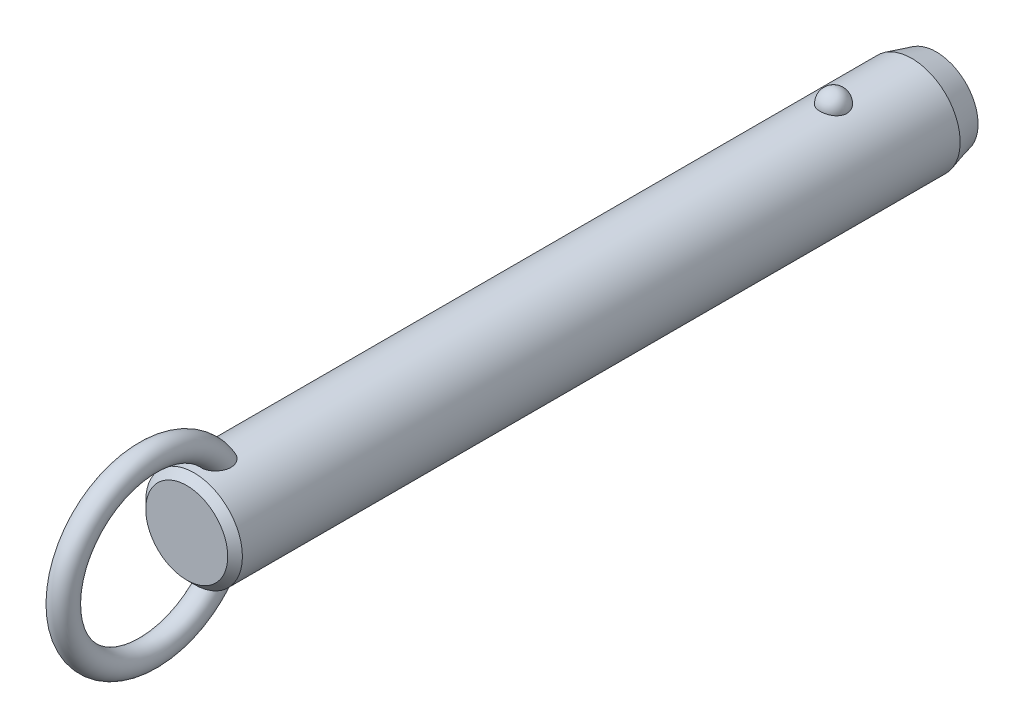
ISO-10303-21;
HEADER;
FILE_DESCRIPTION(('STEP AP214'),'2;1');
FILE_NAME('part.step','',(''),(''),'','','');
FILE_SCHEMA(('AUTOMOTIVE_DESIGN { 1 0 10303 214 1 1 1 1 }'));
ENDSEC;
DATA;
#1=APPLICATION_CONTEXT('core data for automotive mechanical design processes');
#2=APPLICATION_PROTOCOL_DEFINITION('international standard','automotive_design',2000,#1);
#3=PRODUCT_CONTEXT('',#1,'mechanical');
#4=PRODUCT('Part','Part','',(#3));
#5=PRODUCT_RELATED_PRODUCT_CATEGORY('part','',(#4));
#6=PRODUCT_DEFINITION_FORMATION('','',#4);
#7=PRODUCT_DEFINITION_CONTEXT('part definition',#1,'design');
#8=PRODUCT_DEFINITION('design','',#6,#7);
#9=PRODUCT_DEFINITION_SHAPE('','',#8);
#10=(LENGTH_UNIT() NAMED_UNIT(*) SI_UNIT(.MILLI.,.METRE.));
#11=(NAMED_UNIT(*) PLANE_ANGLE_UNIT() SI_UNIT($,.RADIAN.));
#12=(NAMED_UNIT(*) SI_UNIT($,.STERADIAN.) SOLID_ANGLE_UNIT());
#13=UNCERTAINTY_MEASURE_WITH_UNIT(LENGTH_MEASURE(1.E-05),#10,'distance_accuracy_value','');
#14=(GEOMETRIC_REPRESENTATION_CONTEXT(3) GLOBAL_UNCERTAINTY_ASSIGNED_CONTEXT((#13)) GLOBAL_UNIT_ASSIGNED_CONTEXT((#10,
#11,#12)) REPRESENTATION_CONTEXT('',''));
#15=CARTESIAN_POINT('',(0.,0.,0.));
#16=DIRECTION('',(0.,0.,1.));
#17=DIRECTION('',(1.,0.,0.));
#18=AXIS2_PLACEMENT_3D('',#15,#16,#17);
#19=CARTESIAN_POINT('',(0.,0.,94.));
#20=DIRECTION('',(0.,0.,-1.));
#21=DIRECTION('',(-1.,0.,0.));
#22=AXIS2_PLACEMENT_3D('',#19,#20,#21);
#23=CYLINDRICAL_SURFACE('',#22,7.9);
#24=CARTESIAN_POINT('',(2.1785689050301,7.59367088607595,-2.19999999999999));
#25=CARTESIAN_POINT('',(2.17856679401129,7.59367269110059,-2.07701843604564));
#26=CARTESIAN_POINT('',(2.16853481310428,7.59657145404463,-1.95401006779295));
#27=CARTESIAN_POINT('',(2.12864689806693,7.607843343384,-1.71147811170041));
#28=CARTESIAN_POINT('',(2.09878338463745,7.61621856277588,-1.59195587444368));
#29=CARTESIAN_POINT('',(2.0199931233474,7.63749180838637,-1.3598563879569));
#30=CARTESIAN_POINT('',(1.97107475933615,7.6503878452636,-1.24727610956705));
#31=CARTESIAN_POINT('',(1.85539377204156,7.67926115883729,-1.03213234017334));
#32=CARTESIAN_POINT('',(1.78863158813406,7.69523835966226,-0.929568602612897));
#33=CARTESIAN_POINT('',(1.63856494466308,7.7285848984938,-0.736786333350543));
#34=CARTESIAN_POINT('',(1.55518140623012,7.7459606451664,-0.646630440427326));
#35=CARTESIAN_POINT('',(1.37422937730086,7.78009978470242,-0.481747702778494));
#36=CARTESIAN_POINT('',(1.27666086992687,7.79686317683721,-0.407020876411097));
#37=CARTESIAN_POINT('',(1.07024728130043,7.82786153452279,-0.275278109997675));
#38=CARTESIAN_POINT('',(0.961434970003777,7.84210353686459,-0.218212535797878));
#39=CARTESIAN_POINT('',(0.735351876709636,7.86652194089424,-0.123146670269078));
#40=CARTESIAN_POINT('',(0.618082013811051,7.87669878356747,-0.085144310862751));
#41=CARTESIAN_POINT('',(0.380637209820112,7.89170521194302,-0.0298158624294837));
#42=CARTESIAN_POINT('',(0.260550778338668,7.89662650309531,-0.0121347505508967));
#43=CARTESIAN_POINT('',(0.0190117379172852,7.90090003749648,0.00324379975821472));
#44=CARTESIAN_POINT('',(-0.102440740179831,7.90025280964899,0.00094313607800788));
#45=CARTESIAN_POINT('',(-0.341452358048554,7.89351056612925,-0.0233955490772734));
#46=CARTESIAN_POINT('',(-0.459042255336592,7.88749257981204,-0.0451545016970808));
#47=CARTESIAN_POINT('',(-0.688796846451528,7.87075812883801,-0.107408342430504));
#48=CARTESIAN_POINT('',(-0.800961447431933,7.86004158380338,-0.147903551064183));
#49=CARTESIAN_POINT('',(-1.01743634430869,7.83497131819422,-0.246799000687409));
#50=CARTESIAN_POINT('',(-1.12169791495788,7.82059709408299,-0.305300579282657));
#51=CARTESIAN_POINT('',(-1.31891765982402,7.78976470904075,-0.438549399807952));
#52=CARTESIAN_POINT('',(-1.41187469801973,7.77330633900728,-0.513298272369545));
#53=CARTESIAN_POINT('',(-1.58577142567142,7.73972434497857,-0.678622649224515));
#54=CARTESIAN_POINT('',(-1.66645140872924,7.72259402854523,-0.769470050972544));
#55=CARTESIAN_POINT('',(-1.81161503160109,7.68983776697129,-0.963538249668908));
#56=CARTESIAN_POINT('',(-1.87609753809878,7.6742119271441,-1.06675991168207));
#57=CARTESIAN_POINT('',(-1.98790138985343,7.6460202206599,-1.28401170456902));
#58=CARTESIAN_POINT('',(-2.03501994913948,7.63349104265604,-1.39815107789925));
#59=CARTESIAN_POINT('',(-2.10986724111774,7.6131449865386,-1.63301784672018));
#60=CARTESIAN_POINT('',(-2.1375965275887,7.60532797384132,-1.75374505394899));
#61=CARTESIAN_POINT('',(-2.17289256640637,7.5953195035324,-1.99782562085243));
#62=CARTESIAN_POINT('',(-2.18054294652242,7.59310471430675,-2.12116592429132));
#63=CARTESIAN_POINT('',(-2.17572919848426,7.59448538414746,-2.36741799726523));
#64=CARTESIAN_POINT('',(-2.1632656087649,7.59808068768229,-2.49032977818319));
#65=CARTESIAN_POINT('',(-2.11865035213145,7.61064035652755,-2.73161015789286));
#66=CARTESIAN_POINT('',(-2.08659579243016,7.61957823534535,-2.84999812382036));
#67=CARTESIAN_POINT('',(-2.00367799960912,7.64179982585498,-3.07955956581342));
#68=CARTESIAN_POINT('',(-1.9528140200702,7.65508371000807,-3.19073275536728));
#69=CARTESIAN_POINT('',(-1.83321113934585,7.68460381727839,-3.40337899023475));
#70=CARTESIAN_POINT('',(-1.76437735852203,7.70085556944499,-3.50479651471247));
#71=CARTESIAN_POINT('',(-1.61069526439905,7.73445734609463,-3.69446912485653));
#72=CARTESIAN_POINT('',(-1.52584634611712,7.75180741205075,-3.78272371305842));
#73=CARTESIAN_POINT('',(-1.34198059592,7.78574608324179,-3.94393987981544));
#74=CARTESIAN_POINT('',(-1.24291308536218,7.80233167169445,-4.01684434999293));
#75=CARTESIAN_POINT('',(-1.03352039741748,7.83281625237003,-4.14489386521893));
#76=CARTESIAN_POINT('',(-0.92319600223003,7.84671543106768,-4.20004014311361));
#77=CARTESIAN_POINT('',(-0.695822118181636,7.87011575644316,-4.29042017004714));
#78=CARTESIAN_POINT('',(-0.578872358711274,7.87966903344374,-4.32589112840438));
#79=CARTESIAN_POINT('',(-0.340410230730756,7.8935652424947,-4.37692226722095));
#80=CARTESIAN_POINT('',(-0.218898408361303,7.89790879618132,-4.39248482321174));
#81=CARTESIAN_POINT('',(0.0228107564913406,7.90087453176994,-4.40314405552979));
#82=CARTESIAN_POINT('',(0.142990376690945,7.89960185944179,-4.39861683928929));
#83=CARTESIAN_POINT('',(0.380829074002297,7.89171262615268,-4.37008293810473));
#84=CARTESIAN_POINT('',(0.498488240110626,7.8850962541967,-4.34607694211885));
#85=CARTESIAN_POINT('',(0.727535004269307,7.86726442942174,-4.27939317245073));
#86=CARTESIAN_POINT('',(0.838944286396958,7.85606616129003,-4.236785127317));
#87=CARTESIAN_POINT('',(1.05295421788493,7.83025654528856,-4.13408348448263));
#88=CARTESIAN_POINT('',(1.15555431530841,7.81564498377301,-4.07398879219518));
#89=CARTESIAN_POINT('',(1.35076763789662,7.7843022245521,-3.93687432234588));
#90=CARTESIAN_POINT('',(1.4432046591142,7.76754209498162,-3.85961036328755));
#91=CARTESIAN_POINT('',(1.6139111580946,7.73387857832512,-3.69076949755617));
#92=CARTESIAN_POINT('',(1.6921781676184,7.71697516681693,-3.59919010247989));
#93=CARTESIAN_POINT('',(1.83380875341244,7.6845643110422,-3.40247278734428));
#94=CARTESIAN_POINT('',(1.89689280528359,7.66908588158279,-3.29712873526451));
#95=CARTESIAN_POINT('',(2.0047823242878,7.64159441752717,-3.07707931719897));
#96=CARTESIAN_POINT('',(2.0495945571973,7.62958010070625,-2.96237743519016));
#97=CARTESIAN_POINT('',(2.11580183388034,7.61146617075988,-2.74040519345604));
#98=CARTESIAN_POINT('',(2.13929812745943,7.60484503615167,-2.63379846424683));
#99=CARTESIAN_POINT('',(2.17068242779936,7.59594664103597,-2.41813481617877));
#100=CARTESIAN_POINT('',(2.17857077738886,7.59366928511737,-2.30907795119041));
#101=CARTESIAN_POINT('',(2.1785689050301,7.59367088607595,-2.19999999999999));
#102=B_SPLINE_CURVE_WITH_KNOTS('',3,(#24,#25,#26,#27,#28,#29,#30,#31,#32,#33,#34,#35,#36,#37,
#38,#39,#40,#41,#42,#43,#44,#45,#46,#47,#48,#49,#50,#51,#52,#53,#54,#55,#56,#57,#58,#59,#60,#61,
#62,#63,#64,#65,#66,#67,#68,#69,#70,#71,#72,#73,#74,#75,#76,#77,#78,#79,#80,#81,#82,#83,#84,#85,
#86,#87,#88,#89,#90,#91,#92,#93,#94,#95,#96,#97,#98,#99,#100,#101),.UNSPECIFIED.,.T.,.F.,(4,2,2,
2,2,2,2,2,2,2,2,2,2,2,2,2,2,2,2,2,2,2,2,2,2,2,2,2,2,2,2,2,2,2,2,2,2,2,4),(0.,0.368552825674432,
0.737246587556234,1.10577831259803,1.4743009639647,1.8446206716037,2.21494081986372,
2.5842105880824,2.95344028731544,3.31611630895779,3.67875788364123,4.03628044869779,
4.39380913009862,4.75338791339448,5.11300280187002,5.47939989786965,5.8458226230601,
6.21639834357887,6.58696347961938,6.95598276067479,7.32499216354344,7.69218715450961,
8.0593967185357,8.42858578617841,8.79778880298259,9.16834203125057,9.5388695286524,
9.90482699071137,10.2707407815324,10.6298333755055,10.9889132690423,11.3466585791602,
11.7044262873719,12.0676511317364,12.4309391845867,12.8004764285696,13.1698767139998,
13.4967701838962,13.8236564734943),.UNSPECIFIED.);
#103=CARTESIAN_POINT('',(2.1785689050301,7.59367088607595,-2.19999999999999));
#104=VERTEX_POINT('',#103);
#105=EDGE_CURVE('E41',#104,#104,#102,.T.);
#106=ORIENTED_EDGE('',*,*,#105,.T.);
#107=EDGE_LOOP('',(#106));
#108=FACE_BOUND('',#107,.T.);
#109=CARTESIAN_POINT('',(0.,0.,102.32));
#110=DIRECTION('',(0.,0.,1.));
#111=DIRECTION('',(1.,0.,0.));
#112=AXIS2_PLACEMENT_3D('',#109,#110,#111);
#113=CIRCLE('',#112,7.9);
#114=CARTESIAN_POINT('',(7.9,0.,102.32));
#115=VERTEX_POINT('',#114);
#116=EDGE_CURVE('E10',#115,#115,#113,.F.);
#117=ORIENTED_EDGE('',*,*,#116,.T.);
#118=EDGE_LOOP('',(#117));
#119=FACE_BOUND('',#118,.T.);
#120=CARTESIAN_POINT('',(-0.630969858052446,-7.87476203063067,96.2124322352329));
#121=CARTESIAN_POINT('',(-0.73418033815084,-7.8664899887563,96.247285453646));
#122=CARTESIAN_POINT('',(-0.834476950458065,-7.85639291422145,96.2908160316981));
#123=CARTESIAN_POINT('',(-1.02620356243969,-7.83366343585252,96.3940948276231));
#124=CARTESIAN_POINT('',(-1.1176141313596,-7.82102565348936,96.4538775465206));
#125=CARTESIAN_POINT('',(-1.28877277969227,-7.79464922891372,96.5878390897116));
#126=CARTESIAN_POINT('',(-1.36854014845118,-7.78091246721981,96.661993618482));
#127=CARTESIAN_POINT('',(-1.5146152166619,-7.75380398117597,96.8224941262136));
#128=CARTESIAN_POINT('',(-1.58092966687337,-7.74043207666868,96.9088339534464));
#129=CARTESIAN_POINT('',(-1.70019064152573,-7.71512522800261,97.0929784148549));
#130=CARTESIAN_POINT('',(-1.75284037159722,-7.70322473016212,97.1909792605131));
#131=CARTESIAN_POINT('',(-1.84263464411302,-7.68224112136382,97.3941029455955));
#132=CARTESIAN_POINT('',(-1.87977299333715,-7.6731591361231,97.4992286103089));
#133=CARTESIAN_POINT('',(-1.94152728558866,-7.65777930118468,97.7232849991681));
#134=CARTESIAN_POINT('',(-1.96475471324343,-7.65179654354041,97.8426167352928));
#135=CARTESIAN_POINT('',(-1.99449499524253,-7.64409642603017,98.0834298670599));
#136=CARTESIAN_POINT('',(-2.0010005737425,-7.64238092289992,98.2049121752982));
#137=CARTESIAN_POINT('',(-1.99856014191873,-7.64302120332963,98.4683409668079));
#138=CARTESIAN_POINT('',(-1.98680021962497,-7.64611845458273,98.6102565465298));
#139=CARTESIAN_POINT('',(-1.9445777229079,-7.65696186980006,98.8911188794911));
#140=CARTESIAN_POINT('',(-1.91409393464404,-7.66471330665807,99.0300620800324));
#141=CARTESIAN_POINT('',(-1.82768670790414,-7.68582947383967,99.331939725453));
#142=CARTESIAN_POINT('',(-1.76772963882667,-7.70003779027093,99.493686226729));
#143=CARTESIAN_POINT('',(-1.65998501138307,-7.72371550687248,99.7276956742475));
#144=CARTESIAN_POINT('',(-1.621079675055,-7.73200670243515,99.8042974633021));
#145=CARTESIAN_POINT('',(-1.53727726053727,-7.74910377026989,99.9540798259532));
#146=CARTESIAN_POINT('',(-1.49238215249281,-7.75790947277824,100.027261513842));
#147=CARTESIAN_POINT('',(-1.3739705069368,-7.77993338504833,100.20288382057));
#148=CARTESIAN_POINT('',(-1.29690364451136,-7.79328473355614,100.302955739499));
#149=CARTESIAN_POINT('',(-1.1288548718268,-7.81939266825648,100.490714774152));
#150=CARTESIAN_POINT('',(-1.03789926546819,-7.83215032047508,100.578424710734));
#151=CARTESIAN_POINT('',(-0.869532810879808,-7.85231710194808,100.713414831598));
#152=CARTESIAN_POINT('',(-0.795716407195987,-7.86021093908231,100.765076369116));
#153=CARTESIAN_POINT('',(-0.640813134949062,-7.87434920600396,100.856381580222));
#154=CARTESIAN_POINT('',(-0.559737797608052,-7.88059619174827,100.89604389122));
#155=CARTESIAN_POINT('',(-0.40645605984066,-7.88984116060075,100.954300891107));
#156=CARTESIAN_POINT('',(-0.335227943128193,-7.89321892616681,100.975384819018));
#157=CARTESIAN_POINT('',(-0.190193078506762,-7.89804235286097,101.00541418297));
#158=CARTESIAN_POINT('',(-0.116388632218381,-7.89948969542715,101.014370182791));
#159=CARTESIAN_POINT('',(0.0318414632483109,-7.90028409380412,101.019291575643));
#160=CARTESIAN_POINT('',(0.106268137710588,-7.89962640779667,101.015227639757));
#161=CARTESIAN_POINT('',(0.253290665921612,-7.8962818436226,100.994461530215));
#162=CARTESIAN_POINT('',(0.32588518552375,-7.8935935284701,100.977750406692));
#163=CARTESIAN_POINT('',(0.481441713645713,-7.88577340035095,100.928738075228));
#164=CARTESIAN_POINT('',(0.563611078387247,-7.88026321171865,100.894005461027));
#165=CARTESIAN_POINT('',(0.721129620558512,-7.86741729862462,100.811796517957));
#166=CARTESIAN_POINT('',(0.796466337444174,-7.86007832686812,100.764297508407));
#167=CARTESIAN_POINT('',(0.971456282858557,-7.84073285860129,100.636513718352));
#168=CARTESIAN_POINT('',(1.0671968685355,-7.82809461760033,100.551004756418));
#169=CARTESIAN_POINT('',(1.24418921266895,-7.80192439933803,100.366232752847));
#170=CARTESIAN_POINT('',(1.32540832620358,-7.78839049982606,100.266939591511));
#171=CARTESIAN_POINT('',(1.45199971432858,-7.76559693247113,100.089576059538));
#172=CARTESIAN_POINT('',(1.50085649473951,-7.75626094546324,100.013954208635));
#173=CARTESIAN_POINT('',(1.59197749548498,-7.7380727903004,99.8587428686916));
#174=CARTESIAN_POINT('',(1.63423919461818,-7.72922080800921,99.7791518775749));
#175=CARTESIAN_POINT('',(1.71222612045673,-7.71231959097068,99.6166640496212));
#176=CARTESIAN_POINT('',(1.74794516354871,-7.70427111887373,99.5337641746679));
#177=CARTESIAN_POINT('',(1.81270113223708,-7.68929240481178,99.3652967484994));
#178=CARTESIAN_POINT('',(1.84173789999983,-7.68236218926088,99.2797291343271));
#179=CARTESIAN_POINT('',(1.89322698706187,-7.66983757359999,99.1052870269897));
#180=CARTESIAN_POINT('',(1.91558744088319,-7.66426199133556,99.0163838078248));
#181=CARTESIAN_POINT('',(1.95281367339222,-7.65485915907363,98.8369696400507));
#182=CARTESIAN_POINT('',(1.96767946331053,-7.65103190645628,98.7464586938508));
#183=CARTESIAN_POINT('',(2.00021456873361,-7.64262981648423,98.4737320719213));
#184=CARTESIAN_POINT('',(2.00600691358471,-7.6410871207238,98.2897099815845));
#185=CARTESIAN_POINT('',(1.98445334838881,-7.64669564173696,97.9765019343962));
#186=CARTESIAN_POINT('',(1.96607186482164,-7.65149688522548,97.8466189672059));
#187=CARTESIAN_POINT('',(1.90884967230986,-7.6659762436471,97.5916321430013));
#188=CARTESIAN_POINT('',(1.8700210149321,-7.67565148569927,97.466525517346));
#189=CARTESIAN_POINT('',(1.77063986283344,-7.69918471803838,97.2245401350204));
#190=CARTESIAN_POINT('',(1.70993724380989,-7.71307150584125,97.1077250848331));
#191=CARTESIAN_POINT('',(1.5673307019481,-7.74330306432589,96.8881444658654));
#192=CARTESIAN_POINT('',(1.48543692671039,-7.75964665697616,96.7853722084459));
#193=CARTESIAN_POINT('',(1.31346177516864,-7.79047523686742,96.6093800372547));
#194=CARTESIAN_POINT('',(1.22547278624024,-7.80495298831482,96.5341066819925));
#195=CARTESIAN_POINT('',(1.03724352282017,-7.83218597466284,96.4004864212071));
#196=CARTESIAN_POINT('',(0.937008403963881,-7.84494192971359,96.3421324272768));
#197=CARTESIAN_POINT('',(0.733599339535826,-7.86649045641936,96.2470270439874));
#198=CARTESIAN_POINT('',(0.630941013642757,-7.87547134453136,96.2092109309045));
#199=CARTESIAN_POINT('',(0.420465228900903,-7.88950708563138,96.1511160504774));
#200=CARTESIAN_POINT('',(0.312645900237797,-7.89456050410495,96.1308436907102));
#201=CARTESIAN_POINT('',(0.0960869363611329,-7.9001518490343,96.1084559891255));
#202=CARTESIAN_POINT('',(-0.0126341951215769,-7.90073226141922,96.1061698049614));
#203=CARTESIAN_POINT('',(-0.228766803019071,-7.89742350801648,96.1193678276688));
#204=CARTESIAN_POINT('',(-0.336180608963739,-7.89354403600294,96.1348134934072));
#205=CARTESIAN_POINT('',(-0.473410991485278,-7.88586871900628,96.1662177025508));
#206=CARTESIAN_POINT('',(-0.505257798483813,-7.88388984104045,96.1743541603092));
#207=CARTESIAN_POINT('',(-0.568481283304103,-7.87958326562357,96.1922083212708));
#208=CARTESIAN_POINT('',(-0.599857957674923,-7.87725556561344,96.2019260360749));
#209=CARTESIAN_POINT('',(-0.630969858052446,-7.87476203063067,96.2124322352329));
#210=B_SPLINE_CURVE_WITH_KNOTS('',3,(#120,#121,#122,#123,#124,#125,#126,#127,#128,#129,#130,
#131,#132,#133,#134,#135,#136,#137,#138,#139,#140,#141,#142,#143,#144,#145,#146,#147,#148,#149,
#150,#151,#152,#153,#154,#155,#156,#157,#158,#159,#160,#161,#162,#163,#164,#165,#166,#167,#168,
#169,#170,#171,#172,#173,#174,#175,#176,#177,#178,#179,#180,#181,#182,#183,#184,#185,#186,#187,
#188,#189,#190,#191,#192,#193,#194,#195,#196,#197,#198,#199,#200,#201,#202,#203,#204,#205,#206,
#207,#208,#209),.UNSPECIFIED.,.T.,.F.,(4,2,2,2,2,2,2,2,2,2,2,2,2,2,2,2,2,2,2,2,2,2,2,2,2,2,2,2,
2,2,2,2,2,2,2,2,2,2,2,2,2,2,2,2,4),(0.,0.327622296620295,0.655945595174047,0.983718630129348,
1.3113267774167,1.64554655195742,1.9798996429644,2.3436572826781,2.70757317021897,
3.13333684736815,3.55958380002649,4.07655306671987,4.3352789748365,4.59391999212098,
4.97382437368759,5.35301797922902,5.62348245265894,5.89352465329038,6.11565959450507,
6.3376009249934,6.56004255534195,6.78264174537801,7.04930844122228,7.31645206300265,
7.70130871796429,8.08701995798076,8.35824509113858,8.62957365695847,8.90115735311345,
9.17274746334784,9.44791855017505,9.72308922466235,10.2715298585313,10.6638393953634,
11.0559179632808,11.4507403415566,11.845374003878,12.1936425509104,12.5417649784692,
12.8695063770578,13.1973674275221,13.5221104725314,13.8461490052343,13.9449071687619,
14.0436660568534),.UNSPECIFIED.);
#211=CARTESIAN_POINT('',(-0.630969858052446,-7.87476203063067,96.2124322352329));
#212=VERTEX_POINT('',#211);
#213=EDGE_CURVE('E59',#212,#212,#210,.T.);
#214=ORIENTED_EDGE('',*,*,#213,.T.);
#215=EDGE_LOOP('',(#214));
#216=FACE_BOUND('',#215,.T.);
#217=CARTESIAN_POINT('',(-0.630969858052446,7.87476203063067,96.2124322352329));
#218=CARTESIAN_POINT('',(-0.528918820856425,7.88293636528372,96.1779798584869));
#219=CARTESIAN_POINT('',(-0.423745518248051,7.8893481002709,96.151915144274));
#220=CARTESIAN_POINT('',(-0.210236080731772,7.8979273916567,96.1172825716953));
#221=CARTESIAN_POINT('',(-0.10189380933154,7.90008607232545,96.1087513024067));
#222=CARTESIAN_POINT('',(0.114660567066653,7.89990877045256,96.1094570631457));
#223=CARTESIAN_POINT('',(0.222872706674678,7.89757640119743,96.1186798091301));
#224=CARTESIAN_POINT('',(0.436107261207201,7.88867538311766,96.1546525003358));
#225=CARTESIAN_POINT('',(0.541131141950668,7.8821087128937,96.1813942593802));
#226=CARTESIAN_POINT('',(0.745085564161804,7.86545130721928,96.2517561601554));
#227=CARTESIAN_POINT('',(0.844015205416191,7.85536005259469,96.2953787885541));
#228=CARTESIAN_POINT('',(1.03299167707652,7.83275153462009,96.3983796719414));
#229=CARTESIAN_POINT('',(1.12303841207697,7.8202342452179,96.4577580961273));
#230=CARTESIAN_POINT('',(1.29214734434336,7.79408219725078,96.5908647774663));
#231=CARTESIAN_POINT('',(1.37116907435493,7.78044359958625,96.6646436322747));
#232=CARTESIAN_POINT('',(1.51597677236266,7.75353170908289,96.8242353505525));
#233=CARTESIAN_POINT('',(1.58176261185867,7.74025841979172,96.9100483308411));
#234=CARTESIAN_POINT('',(1.70057386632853,7.71504069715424,97.093644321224));
#235=CARTESIAN_POINT('',(1.75320073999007,7.70314257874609,97.1916906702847));
#236=CARTESIAN_POINT('',(1.84293767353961,7.68216822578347,97.3948931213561));
#237=CARTESIAN_POINT('',(1.88004278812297,7.67309289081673,97.5000514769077));
#238=CARTESIAN_POINT('',(1.9417232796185,7.6577294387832,97.7241671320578));
#239=CARTESIAN_POINT('',(1.96491037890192,7.65175648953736,97.8435248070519));
#240=CARTESIAN_POINT('',(1.9945689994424,7.64407702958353,98.0843848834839));
#241=CARTESIAN_POINT('',(2.00103304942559,7.64237242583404,98.2058882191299));
#242=CARTESIAN_POINT('',(1.9985016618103,7.64303650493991,98.4693688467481));
#243=CARTESIAN_POINT('',(1.98669038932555,7.64614714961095,98.6113141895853));
#244=CARTESIAN_POINT('',(1.94436120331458,7.6570170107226,98.8922287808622));
#245=CARTESIAN_POINT('',(1.9138220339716,7.66478150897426,99.0311944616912));
#246=CARTESIAN_POINT('',(1.82728754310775,7.68592483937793,99.3331110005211));
#247=CARTESIAN_POINT('',(1.76725778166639,7.7001468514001,99.494872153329));
#248=CARTESIAN_POINT('',(1.65939700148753,7.72384204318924,99.7288914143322));
#249=CARTESIAN_POINT('',(1.62045187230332,7.73213852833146,99.8054942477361));
#250=CARTESIAN_POINT('',(1.53656684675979,7.74924489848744,99.9552737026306));
#251=CARTESIAN_POINT('',(1.49162892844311,7.75805461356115,100.028451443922));
#252=CARTESIAN_POINT('',(1.37317698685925,7.78007342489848,100.203952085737));
#253=CARTESIAN_POINT('',(1.29612360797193,7.79341423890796,100.303911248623));
#254=CARTESIAN_POINT('',(1.12812043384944,7.81949839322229,100.49145083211));
#255=CARTESIAN_POINT('',(1.03719688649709,7.83224280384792,100.579054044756));
#256=CARTESIAN_POINT('',(0.868871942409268,7.85239026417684,100.71389715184));
#257=CARTESIAN_POINT('',(0.795056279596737,7.86027769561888,100.765511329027));
#258=CARTESIAN_POINT('',(0.640160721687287,7.87440222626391,100.856720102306));
#259=CARTESIAN_POINT('',(0.559092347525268,7.88064188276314,100.896333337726));
#260=CARTESIAN_POINT('',(0.405820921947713,7.8898738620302,100.954505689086));
#261=CARTESIAN_POINT('',(0.334594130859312,7.89324577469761,100.975552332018));
#262=CARTESIAN_POINT('',(0.189568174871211,7.89805733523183,101.005507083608));
#263=CARTESIAN_POINT('',(0.115771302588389,7.89949866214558,101.014425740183));
#264=CARTESIAN_POINT('',(-0.032435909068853,7.90028156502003,101.01927589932));
#265=CARTESIAN_POINT('',(-0.106847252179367,7.89961843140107,101.015178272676));
#266=CARTESIAN_POINT('',(-0.253834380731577,7.8962642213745,100.994351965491));
#267=CARTESIAN_POINT('',(-0.326408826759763,7.89357170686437,100.977614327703));
#268=CARTESIAN_POINT('',(-0.481962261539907,7.88574179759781,100.928539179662));
#269=CARTESIAN_POINT('',(-0.564145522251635,7.88022507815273,100.893763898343));
#270=CARTESIAN_POINT('',(-0.72168526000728,7.8673664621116,100.811468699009));
#271=CARTESIAN_POINT('',(-0.797029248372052,7.8600213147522,100.763926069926));
#272=CARTESIAN_POINT('',(-0.972044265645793,7.84066026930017,100.636026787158));
#273=CARTESIAN_POINT('',(-1.06779803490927,7.82801274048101,100.550443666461));
#274=CARTESIAN_POINT('',(-1.24480531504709,7.80182621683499,100.365522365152));
#275=CARTESIAN_POINT('',(-1.32602618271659,7.78828530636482,100.266154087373));
#276=CARTESIAN_POINT('',(-1.45259834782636,7.76548487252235,100.088680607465));
#277=CARTESIAN_POINT('',(-1.50143856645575,7.75614818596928,100.013025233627));
#278=CARTESIAN_POINT('',(-1.59252410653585,7.73796020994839,99.8577484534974));
#279=CARTESIAN_POINT('',(-1.63476690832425,7.72910910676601,99.7781255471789));
#280=CARTESIAN_POINT('',(-1.71271318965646,7.71221133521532,99.6155750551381));
#281=CARTESIAN_POINT('',(-1.74841047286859,7.70416543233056,99.5326444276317));
#282=CARTESIAN_POINT('',(-1.81311929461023,7.6891937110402,99.3641168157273));
#283=CARTESIAN_POINT('',(-1.84213067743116,7.6822679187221,99.2785197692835));
#284=CARTESIAN_POINT('',(-1.89356259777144,7.66975461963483,99.1040254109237));
#285=CARTESIAN_POINT('',(-1.91589165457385,7.66418586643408,99.0150995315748));
#286=CARTESIAN_POINT('',(-1.95305070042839,7.65479859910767,98.8356424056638));
#287=CARTESIAN_POINT('',(-1.96788069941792,7.65098008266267,98.7451111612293));
#288=CARTESIAN_POINT('',(-2.00030078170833,7.64260704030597,98.4723270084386));
#289=CARTESIAN_POINT('',(-2.00600576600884,7.64108760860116,98.2882718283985));
#290=CARTESIAN_POINT('',(-1.98428483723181,7.64673945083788,97.9750800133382));
#291=CARTESIAN_POINT('',(-1.96583698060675,7.6515575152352,97.8452400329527));
#292=CARTESIAN_POINT('',(-1.90848948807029,7.66606613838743,97.5903619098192));
#293=CARTESIAN_POINT('',(-1.86960376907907,7.67575338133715,97.465320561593));
#294=CARTESIAN_POINT('',(-1.7701342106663,7.69930132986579,97.2235009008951));
#295=CARTESIAN_POINT('',(-1.70940488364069,7.71318991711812,97.1067844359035));
#296=CARTESIAN_POINT('',(-1.56672953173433,7.74342495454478,96.8873404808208));
#297=CARTESIAN_POINT('',(-1.48478316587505,7.75977144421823,96.7846132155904));
#298=CARTESIAN_POINT('',(-1.31266325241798,7.79061163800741,96.6086431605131));
#299=CARTESIAN_POINT('',(-1.22456383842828,7.80509908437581,96.5333589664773));
#300=CARTESIAN_POINT('',(-1.03622400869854,7.83231881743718,96.3998659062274));
#301=CARTESIAN_POINT('',(-0.936015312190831,7.84505551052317,96.3416137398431));
#302=CARTESIAN_POINT('',(-0.798824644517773,7.85957802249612,96.2775408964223));
#303=CARTESIAN_POINT('',(-0.765787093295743,7.86286821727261,96.2632248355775));
#304=CARTESIAN_POINT('',(-0.698939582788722,7.86909211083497,96.236436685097));
#305=CARTESIAN_POINT('',(-0.66512963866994,7.8720258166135,96.2239645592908));
#306=CARTESIAN_POINT('',(-0.630969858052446,7.87476203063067,96.2124322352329));
#307=B_SPLINE_CURVE_WITH_KNOTS('',3,(#217,#218,#219,#220,#221,#222,#223,#224,#225,#226,#227,
#228,#229,#230,#231,#232,#233,#234,#235,#236,#237,#238,#239,#240,#241,#242,#243,#244,#245,#246,
#247,#248,#249,#250,#251,#252,#253,#254,#255,#256,#257,#258,#259,#260,#261,#262,#263,#264,#265,
#266,#267,#268,#269,#270,#271,#272,#273,#274,#275,#276,#277,#278,#279,#280,#281,#282,#283,#284,
#285,#286,#287,#288,#289,#290,#291,#292,#293,#294,#295,#296,#297,#298,#299,#300,#301,#302,#303,
#304,#305,#306),.UNSPECIFIED.,.T.,.F.,(4,2,2,2,2,2,2,2,2,2,2,2,2,2,2,2,2,2,2,2,2,2,2,2,2,2,2,2,
2,2,2,2,2,2,2,2,2,2,2,2,2,2,2,2,4),(0.,0.323920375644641,0.648516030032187,0.97285063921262,
1.29703380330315,1.62126473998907,1.94549915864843,2.27089401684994,2.5962920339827,
2.93059633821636,3.26500707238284,3.62881644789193,3.99278833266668,4.41865421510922,
4.84500434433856,5.36209210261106,5.62087589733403,5.87957448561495,6.25918598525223,
6.63808782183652,6.90846748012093,7.17842501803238,7.40052350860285,7.62242871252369,
7.84483086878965,8.06739077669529,8.33414615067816,8.60137921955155,8.98641454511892,
9.3723041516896,9.64358673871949,9.91497268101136,10.1866142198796,10.4582620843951,
10.7334745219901,11.0086865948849,11.5572126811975,11.9494246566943,12.3413699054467,
12.7359755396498,13.1305875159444,13.4791770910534,13.82687259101,13.9353013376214,
14.0437279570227),.UNSPECIFIED.);
#308=CARTESIAN_POINT('',(-0.630969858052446,7.87476203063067,96.2124322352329));
#309=VERTEX_POINT('',#308);
#310=EDGE_CURVE('E67',#309,#309,#307,.T.);
#311=ORIENTED_EDGE('',*,*,#310,.T.);
#312=EDGE_LOOP('',(#311));
#313=FACE_BOUND('',#312,.T.);
#314=CARTESIAN_POINT('',(0.,0.,-15.));
#315=DIRECTION('',(0.,0.,-1.));
#316=DIRECTION('',(-1.,0.,0.));
#317=AXIS2_PLACEMENT_3D('',#314,#315,#316);
#318=CIRCLE('',#317,7.9);
#319=CARTESIAN_POINT('',(-7.9,0.,-15.));
#320=VERTEX_POINT('',#319);
#321=EDGE_CURVE('E56',#320,#320,#318,.F.);
#322=ORIENTED_EDGE('',*,*,#321,.T.);
#323=EDGE_LOOP('',(#322));
#324=FACE_BOUND('',#323,.T.);
#325=ADVANCED_FACE('F37',(#108,#119,#216,#313,#324),#23,.T.);
#326=CARTESIAN_POINT('',(0.,0.,-19.));
#327=DIRECTION('',(0.,0.,-1.));
#328=DIRECTION('',(-1.,0.,0.));
#329=AXIS2_PLACEMENT_3D('',#326,#327,#328);
#330=PLANE('',#329);
#331=CARTESIAN_POINT('',(0.,0.,-19.));
#332=DIRECTION('',(0.,0.,-1.));
#333=DIRECTION('',(-1.,0.,0.));
#334=AXIS2_PLACEMENT_3D('',#331,#332,#333);
#335=CIRCLE('',#334,6.82820323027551);
#336=CARTESIAN_POINT('',(-6.82820323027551,0.,-19.));
#337=VERTEX_POINT('',#336);
#338=EDGE_CURVE('E66',#337,#337,#335,.T.);
#339=ORIENTED_EDGE('',*,*,#338,.T.);
#340=EDGE_LOOP('',(#339));
#341=FACE_BOUND('',#340,.T.);
#342=ADVANCED_FACE('F85',(#341),#330,.T.);
#343=CARTESIAN_POINT('',(0.,0.,-19.));
#344=DIRECTION('',(0.,0.,1.));
#345=DIRECTION('',(1.,0.,0.));
#346=AXIS2_PLACEMENT_3D('',#343,#344,#345);
#347=CONICAL_SURFACE('',#346,6.82820323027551,0.261799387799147);
#348=ORIENTED_EDGE('',*,*,#321,.F.);
#349=EDGE_LOOP('',(#348));
#350=FACE_BOUND('',#349,.T.);
#351=ORIENTED_EDGE('',*,*,#338,.F.);
#352=EDGE_LOOP('',(#351));
#353=FACE_BOUND('',#352,.T.);
#354=ADVANCED_FACE('F83',(#350,#353),#347,.T.);
#355=CARTESIAN_POINT('',(0.,0.,103.52));
#356=DIRECTION('',(0.,0.,1.));
#357=DIRECTION('',(1.,0.,0.));
#358=AXIS2_PLACEMENT_3D('',#355,#356,#357);
#359=PLANE('',#358);
#360=CARTESIAN_POINT('',(0.,0.,103.52));
#361=DIRECTION('',(0.,0.,1.));
#362=DIRECTION('',(1.,0.,0.));
#363=AXIS2_PLACEMENT_3D('',#360,#361,#362);
#364=CIRCLE('',#363,6.70000000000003);
#365=CARTESIAN_POINT('',(6.70000000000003,0.,103.52));
#366=VERTEX_POINT('',#365);
#367=EDGE_CURVE('E50',#366,#366,#364,.T.);
#368=ORIENTED_EDGE('',*,*,#367,.T.);
#369=EDGE_LOOP('',(#368));
#370=FACE_BOUND('',#369,.T.);
#371=ADVANCED_FACE('F77',(#370),#359,.T.);
#372=CARTESIAN_POINT('',(0.,0.,109.85));
#373=DIRECTION('',(1.,0.,0.));
#374=DIRECTION('',(0.,0.,-1.));
#375=AXIS2_PLACEMENT_3D('',#372,#373,#374);
#376=TOROIDAL_SURFACE('',#375,13.85,2.);
#377=ORIENTED_EDGE('',*,*,#310,.F.);
#378=EDGE_LOOP('',(#377));
#379=FACE_BOUND('',#378,.T.);
#380=ORIENTED_EDGE('',*,*,#213,.F.);
#381=EDGE_LOOP('',(#380));
#382=FACE_BOUND('',#381,.T.);
#383=ADVANCED_FACE('F73',(#379,#382),#376,.T.);
#384=CARTESIAN_POINT('',(0.,0.,103.52));
#385=DIRECTION('',(0.,0.,-1.));
#386=DIRECTION('',(-1.,0.,0.));
#387=AXIS2_PLACEMENT_3D('',#384,#385,#386);
#388=CONICAL_SURFACE('',#387,6.70000000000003,0.785398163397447);
#389=ORIENTED_EDGE('',*,*,#116,.F.);
#390=EDGE_LOOP('',(#389));
#391=FACE_BOUND('',#390,.T.);
#392=ORIENTED_EDGE('',*,*,#367,.F.);
#393=EDGE_LOOP('',(#392));
#394=FACE_BOUND('',#393,.T.);
#395=ADVANCED_FACE('F39',(#391,#394),#388,.T.);
#396=CARTESIAN_POINT('',(0.,7.9,-2.19999999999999));
#397=DIRECTION('',(0.,1.,0.));
#398=DIRECTION('',(0.,0.,-1.));
#399=AXIS2_PLACEMENT_3D('',#396,#397,#398);
#400=SPHERICAL_SURFACE('',#399,2.2);
#401=ORIENTED_EDGE('',*,*,#105,.F.);
#402=EDGE_LOOP('',(#401));
#403=FACE_BOUND('',#402,.T.);
#404=ADVANCED_FACE('F79',(#403),#400,.T.);
#405=CLOSED_SHELL('',(#325,#342,#354,#371,#383,#395,#404));
#406=MANIFOLD_SOLID_BREP('B2',#405);
#407=ADVANCED_BREP_SHAPE_REPRESENTATION('',(#18,#406),#14);
#408=SHAPE_DEFINITION_REPRESENTATION(#9,#407);
ENDSEC;
END-ISO-10303-21;
